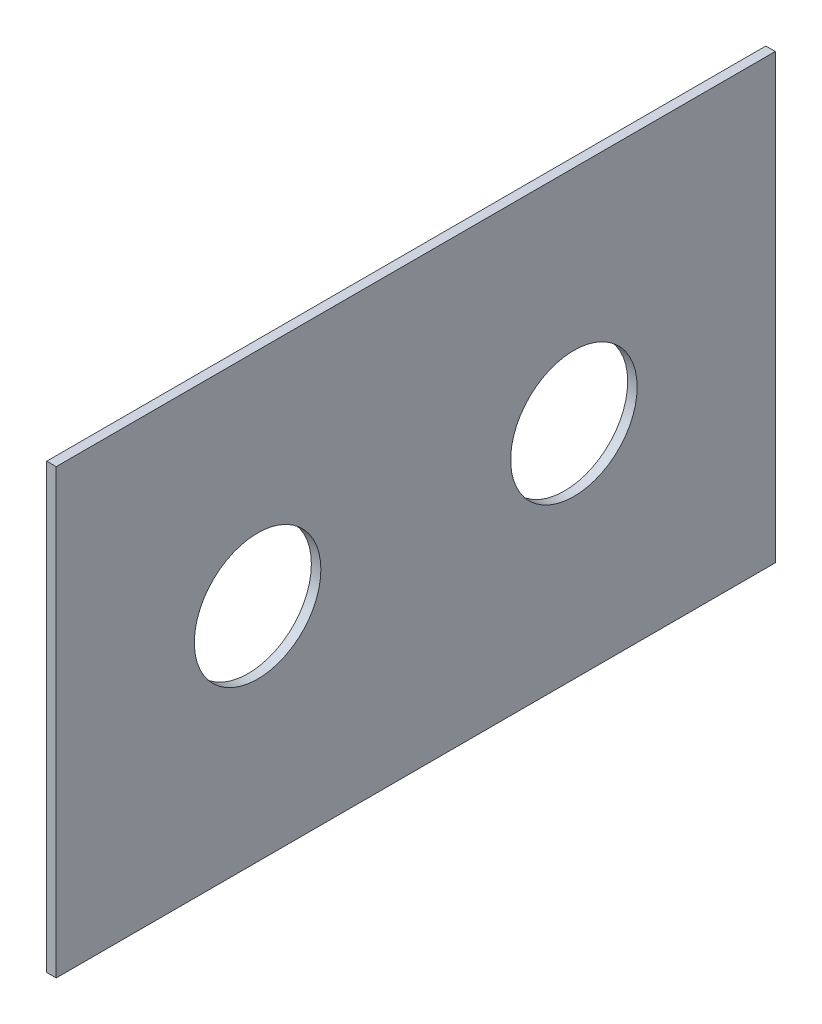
from build123d import *

# Parameters (mm, degrees)
SKETCH1_W           = 682
SKETCH1_H           = 420
BOSS_EXTRUDE1_DEPTH = 9
SKETCH2_R           = 60
CUT_EXTRUDE1_DEPTH  = 401.577083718


with BuildPart() as part:
    # Sketch1 → Boss-Extrude1 (new body)
    with BuildSketch(Plane(origin=(0, 0, 0), x_dir=(0, 0, -1), z_dir=(1, 0, 0))):
        Rectangle(SKETCH1_W, SKETCH1_H)
    extrude(amount=BOSS_EXTRUDE1_DEPTH)

    # Sketch2 → Cut-Extrude1 (cut, through all)
    with BuildSketch(Plane(origin=(9, 0, 0), x_dir=(0, 0, -1), z_dir=(1, 0, 0))):
        with Locations((-150, 0)):
            Circle(SKETCH2_R)
        with Locations((150, 0)):
            Circle(SKETCH2_R)
    extrude(amount=-CUT_EXTRUDE1_DEPTH, mode=Mode.SUBTRACT)


solid = part.part
